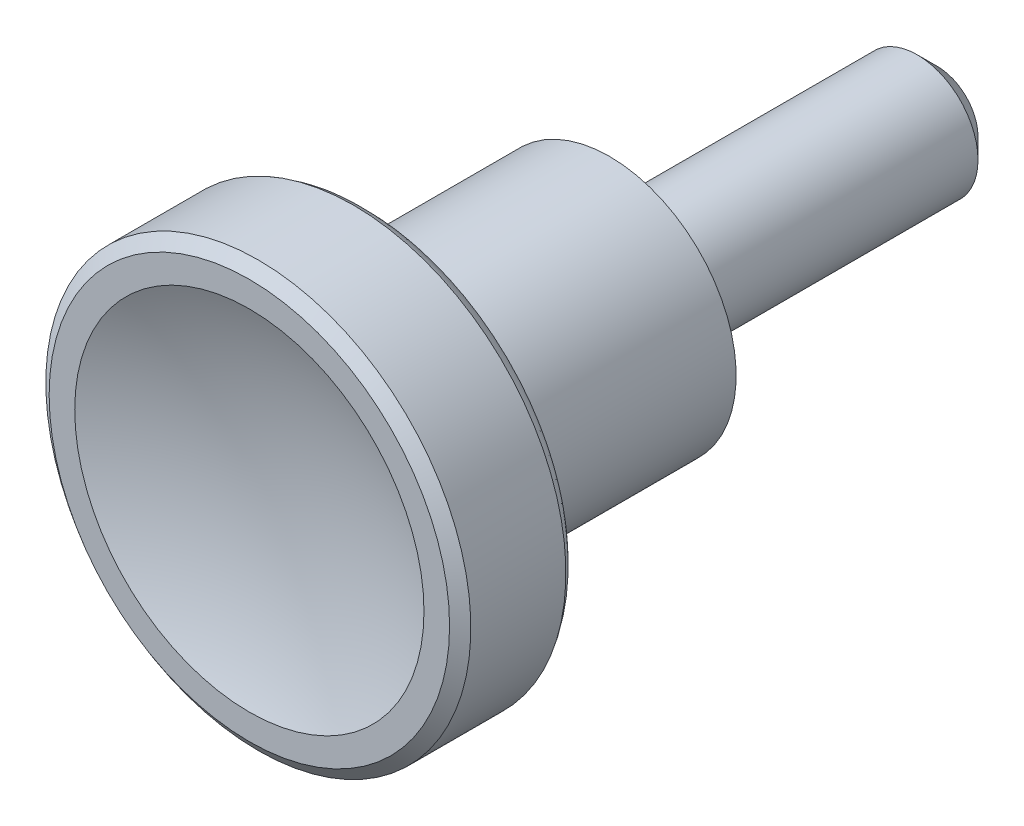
ISO-10303-21;
HEADER;
FILE_DESCRIPTION(('STEP AP214'),'2;1');
FILE_NAME('part.step','',(''),(''),'','','');
FILE_SCHEMA(('AUTOMOTIVE_DESIGN { 1 0 10303 214 1 1 1 1 }'));
ENDSEC;
DATA;
#1=APPLICATION_CONTEXT('core data for automotive mechanical design processes');
#2=APPLICATION_PROTOCOL_DEFINITION('international standard','automotive_design',2000,#1);
#3=PRODUCT_CONTEXT('',#1,'mechanical');
#4=PRODUCT('Part','Part','',(#3));
#5=PRODUCT_RELATED_PRODUCT_CATEGORY('part','',(#4));
#6=PRODUCT_DEFINITION_FORMATION('','',#4);
#7=PRODUCT_DEFINITION_CONTEXT('part definition',#1,'design');
#8=PRODUCT_DEFINITION('design','',#6,#7);
#9=PRODUCT_DEFINITION_SHAPE('','',#8);
#10=(LENGTH_UNIT() NAMED_UNIT(*) SI_UNIT(.MILLI.,.METRE.));
#11=(NAMED_UNIT(*) PLANE_ANGLE_UNIT() SI_UNIT($,.RADIAN.));
#12=(NAMED_UNIT(*) SI_UNIT($,.STERADIAN.) SOLID_ANGLE_UNIT());
#13=UNCERTAINTY_MEASURE_WITH_UNIT(LENGTH_MEASURE(1.E-05),#10,'distance_accuracy_value','');
#14=(GEOMETRIC_REPRESENTATION_CONTEXT(3) GLOBAL_UNCERTAINTY_ASSIGNED_CONTEXT((#13)) GLOBAL_UNIT_ASSIGNED_CONTEXT((#10,
#11,#12)) REPRESENTATION_CONTEXT('',''));
#15=CARTESIAN_POINT('',(0.,0.,0.));
#16=DIRECTION('',(0.,0.,1.));
#17=DIRECTION('',(1.,0.,0.));
#18=AXIS2_PLACEMENT_3D('',#15,#16,#17);
#19=CARTESIAN_POINT('',(2.5,0.,0.));
#20=DIRECTION('',(0.,0.,1.));
#21=DIRECTION('',(0.,-1.,0.));
#22=AXIS2_PLACEMENT_3D('',#19,#20,#21);
#23=PLANE('',#22);
#24=CARTESIAN_POINT('',(0.,0.,0.));
#25=DIRECTION('',(0.,0.,1.));
#26=DIRECTION('',(0.,-1.,0.));
#27=AXIS2_PLACEMENT_3D('',#24,#25,#26);
#28=CIRCLE('',#27,4.);
#29=CARTESIAN_POINT('',(0.,-4.,0.));
#30=VERTEX_POINT('',#29);
#31=EDGE_CURVE('E53',#30,#30,#28,.T.);
#32=ORIENTED_EDGE('',*,*,#31,.F.);
#33=EDGE_LOOP('',(#32));
#34=FACE_BOUND('',#33,.T.);
#35=CARTESIAN_POINT('',(0.,0.,0.));
#36=DIRECTION('',(0.,0.,1.));
#37=DIRECTION('',(1.,0.,0.));
#38=AXIS2_PLACEMENT_3D('',#35,#36,#37);
#39=CIRCLE('',#38,3.);
#40=CARTESIAN_POINT('',(3.,0.,0.));
#41=VERTEX_POINT('',#40);
#42=EDGE_CURVE('E23',#41,#41,#39,.F.);
#43=ORIENTED_EDGE('',*,*,#42,.F.);
#44=EDGE_LOOP('',(#43));
#45=FACE_BOUND('',#44,.T.);
#46=ADVANCED_FACE('F12',(#34,#45),#23,.F.);
#47=CARTESIAN_POINT('',(4.0000061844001,0.,0.2));
#48=DIRECTION('',(0.,0.,1.));
#49=DIRECTION('',(0.,-1.,0.));
#50=AXIS2_PLACEMENT_3D('',#47,#48,#49);
#51=PLANE('',#50);
#52=CARTESIAN_POINT('',(0.,0.,0.2));
#53=DIRECTION('',(0.,0.,1.));
#54=DIRECTION('',(0.,-1.,0.));
#55=AXIS2_PLACEMENT_3D('',#52,#53,#54);
#56=CIRCLE('',#55,6.25);
#57=CARTESIAN_POINT('',(0.,-6.25,0.2));
#58=VERTEX_POINT('',#57);
#59=EDGE_CURVE('E27',#58,#58,#56,.T.);
#60=ORIENTED_EDGE('',*,*,#59,.F.);
#61=EDGE_LOOP('',(#60));
#62=FACE_BOUND('',#61,.T.);
#63=CARTESIAN_POINT('',(0.,0.,0.2));
#64=DIRECTION('',(0.,0.,1.));
#65=DIRECTION('',(0.,-1.,0.));
#66=AXIS2_PLACEMENT_3D('',#63,#64,#65);
#67=CIRCLE('',#66,4.00000618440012);
#68=CARTESIAN_POINT('',(0.,-4.00000618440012,0.2));
#69=VERTEX_POINT('',#68);
#70=EDGE_CURVE('E56',#69,#69,#67,.T.);
#71=ORIENTED_EDGE('',*,*,#70,.T.);
#72=EDGE_LOOP('',(#71));
#73=FACE_BOUND('',#72,.T.);
#74=ADVANCED_FACE('F60',(#62,#73),#51,.F.);
#75=CARTESIAN_POINT('',(0.,0.,-4.66300152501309));
#76=DIRECTION('',(0.,0.,1.));
#77=DIRECTION('',(0.,-1.,0.));
#78=AXIS2_PLACEMENT_3D('',#75,#76,#77);
#79=CYLINDRICAL_SURFACE('',#78,6.25);
#80=CARTESIAN_POINT('',(0.,0.,10.5));
#81=DIRECTION('',(0.,0.,1.));
#82=DIRECTION('',(0.,-1.,0.));
#83=AXIS2_PLACEMENT_3D('',#80,#81,#82);
#84=CIRCLE('',#83,6.25);
#85=CARTESIAN_POINT('',(0.,-6.25,10.5));
#86=VERTEX_POINT('',#85);
#87=EDGE_CURVE('E32',#86,#86,#84,.T.);
#88=ORIENTED_EDGE('',*,*,#87,.F.);
#89=EDGE_LOOP('',(#88));
#90=FACE_BOUND('',#89,.T.);
#91=ORIENTED_EDGE('',*,*,#59,.T.);
#92=EDGE_LOOP('',(#91));
#93=FACE_BOUND('',#92,.T.);
#94=ADVANCED_FACE('F86',(#90,#93),#79,.T.);
#95=CARTESIAN_POINT('',(0.,0.,10.4930187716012));
#96=DIRECTION('',(0.,0.,1.));
#97=DIRECTION('',(0.,-1.,0.));
#98=AXIS2_PLACEMENT_3D('',#95,#96,#97);
#99=TOROIDAL_SURFACE('',#98,7.04996953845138,0.800000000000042);
#100=ORIENTED_EDGE('',*,*,#87,.T.);
#101=EDGE_LOOP('',(#100));
#102=FACE_BOUND('',#101,.T.);
#103=CARTESIAN_POINT('',(0.,0.,11.2657594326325));
#104=DIRECTION('',(0.,0.,1.));
#105=DIRECTION('',(0.,-1.,0.));
#106=AXIS2_PLACEMENT_3D('',#103,#104,#105);
#107=CIRCLE('',#106,6.84291430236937);
#108=CARTESIAN_POINT('',(0.,-6.84291430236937,11.2657594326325));
#109=VERTEX_POINT('',#108);
#110=EDGE_CURVE('E35',#109,#109,#107,.T.);
#111=ORIENTED_EDGE('',*,*,#110,.F.);
#112=EDGE_LOOP('',(#111));
#113=FACE_BOUND('',#112,.T.);
#114=ADVANCED_FACE('F111',(#102,#113),#99,.F.);
#115=CARTESIAN_POINT('',(0.,0.,11.8244404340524));
#116=DIRECTION('',(0.,0.,1.));
#117=DIRECTION('',(0.,-1.,0.));
#118=AXIS2_PLACEMENT_3D('',#115,#116,#117);
#119=CONICAL_SURFACE('',#118,8.92794018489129,1.30899693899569);
#120=ORIENTED_EDGE('',*,*,#110,.T.);
#121=EDGE_LOOP('',(#120));
#122=FACE_BOUND('',#121,.T.);
#123=CARTESIAN_POINT('',(0.,0.,11.8244404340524));
#124=DIRECTION('',(0.,0.,1.));
#125=DIRECTION('',(0.,-1.,0.));
#126=AXIS2_PLACEMENT_3D('',#123,#124,#125);
#127=CIRCLE('',#126,8.92794018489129);
#128=CARTESIAN_POINT('',(0.,-8.92794018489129,11.8244404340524));
#129=VERTEX_POINT('',#128);
#130=EDGE_CURVE('E38',#129,#129,#127,.T.);
#131=ORIENTED_EDGE('',*,*,#130,.F.);
#132=EDGE_LOOP('',(#131));
#133=FACE_BOUND('',#132,.T.);
#134=ADVANCED_FACE('F107',(#122,#133),#119,.T.);
#135=CARTESIAN_POINT('',(0.,0.,13.8158755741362));
#136=DIRECTION('',(0.,0.,1.));
#137=DIRECTION('',(0.,-1.,0.));
#138=AXIS2_PLACEMENT_3D('',#135,#136,#137);
#139=TOROIDAL_SURFACE('',#138,8.74304539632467,2.);
#140=CARTESIAN_POINT('',(0.,0.,12.860307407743));
#141=DIRECTION('',(0.,0.,1.));
#142=DIRECTION('',(0.,-1.,0.));
#143=AXIS2_PLACEMENT_3D('',#140,#141,#142);
#144=CIRCLE('',#143,10.5);
#145=CARTESIAN_POINT('',(0.,-10.5,12.860307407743));
#146=VERTEX_POINT('',#145);
#147=EDGE_CURVE('E41',#146,#146,#144,.T.);
#148=ORIENTED_EDGE('',*,*,#147,.F.);
#149=EDGE_LOOP('',(#148));
#150=FACE_BOUND('',#149,.T.);
#151=ORIENTED_EDGE('',*,*,#130,.T.);
#152=EDGE_LOOP('',(#151));
#153=FACE_BOUND('',#152,.T.);
#154=ADVANCED_FACE('F103',(#150,#153),#139,.T.);
#155=CARTESIAN_POINT('',(0.,0.,-4.66300152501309));
#156=DIRECTION('',(0.,0.,1.));
#157=DIRECTION('',(0.,-1.,0.));
#158=AXIS2_PLACEMENT_3D('',#155,#156,#157);
#159=CYLINDRICAL_SURFACE('',#158,10.5);
#160=ORIENTED_EDGE('',*,*,#147,.T.);
#161=EDGE_LOOP('',(#160));
#162=FACE_BOUND('',#161,.T.);
#163=CARTESIAN_POINT('',(0.,0.,17.5568228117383));
#164=DIRECTION('',(0.,0.,1.));
#165=DIRECTION('',(0.,-1.,0.));
#166=AXIS2_PLACEMENT_3D('',#163,#164,#165);
#167=CIRCLE('',#166,10.5);
#168=CARTESIAN_POINT('',(0.,-10.5,17.5568228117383));
#169=VERTEX_POINT('',#168);
#170=EDGE_CURVE('E44',#169,#169,#167,.T.);
#171=ORIENTED_EDGE('',*,*,#170,.F.);
#172=EDGE_LOOP('',(#171));
#173=FACE_BOUND('',#172,.T.);
#174=ADVANCED_FACE('F99',(#162,#173),#159,.T.);
#175=CARTESIAN_POINT('',(0.,0.,18.));
#176=DIRECTION('',(0.,0.,-1.));
#177=DIRECTION('',(0.,1.,0.));
#178=AXIS2_PLACEMENT_3D('',#175,#176,#177);
#179=CONICAL_SURFACE('',#178,9.89229141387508,0.94070188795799);
#180=ORIENTED_EDGE('',*,*,#170,.T.);
#181=EDGE_LOOP('',(#180));
#182=FACE_BOUND('',#181,.T.);
#183=CARTESIAN_POINT('',(0.,0.,18.));
#184=DIRECTION('',(0.,0.,1.));
#185=DIRECTION('',(0.,-1.,0.));
#186=AXIS2_PLACEMENT_3D('',#183,#184,#185);
#187=CIRCLE('',#186,9.89229141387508);
#188=CARTESIAN_POINT('',(0.,-9.89229141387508,18.));
#189=VERTEX_POINT('',#188);
#190=EDGE_CURVE('E47',#189,#189,#187,.T.);
#191=ORIENTED_EDGE('',*,*,#190,.F.);
#192=EDGE_LOOP('',(#191));
#193=FACE_BOUND('',#192,.T.);
#194=ADVANCED_FACE('F95',(#182,#193),#179,.T.);
#195=CARTESIAN_POINT('',(9.89229141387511,0.,18.));
#196=DIRECTION('',(0.,0.,-1.));
#197=DIRECTION('',(0.,1.,0.));
#198=AXIS2_PLACEMENT_3D('',#195,#196,#197);
#199=PLANE('',#198);
#200=CARTESIAN_POINT('',(0.,0.,18.));
#201=DIRECTION('',(0.,0.,1.));
#202=DIRECTION('',(0.,-1.,0.));
#203=AXIS2_PLACEMENT_3D('',#200,#201,#202);
#204=CIRCLE('',#203,8.62772401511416);
#205=CARTESIAN_POINT('',(0.,-8.62772401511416,18.));
#206=VERTEX_POINT('',#205);
#207=EDGE_CURVE('E50',#206,#206,#204,.T.);
#208=ORIENTED_EDGE('',*,*,#207,.F.);
#209=EDGE_LOOP('',(#208));
#210=FACE_BOUND('',#209,.T.);
#211=ORIENTED_EDGE('',*,*,#190,.T.);
#212=EDGE_LOOP('',(#211));
#213=FACE_BOUND('',#212,.T.);
#214=ADVANCED_FACE('F76',(#210,#213),#199,.F.);
#215=CARTESIAN_POINT('',(0.,0.,37.5129983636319));
#216=DIRECTION('',(0.,-1.,0.));
#217=DIRECTION('',(1.,0.,0.));
#218=AXIS2_PLACEMENT_3D('',#215,#216,#217);
#219=SPHERICAL_SURFACE('',#218,21.3352929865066);
#220=CARTESIAN_POINT('',(0.,0.,37.5129983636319));
#221=DIRECTION('',(0.,0.,1.));
#222=DIRECTION('',(0.,-1.,0.));
#223=AXIS2_PLACEMENT_3D('',#220,#221,#222);
#224=SPHERICAL_SURFACE('',#223,21.3352929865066);
#225=ORIENTED_EDGE('',*,*,#207,.T.);
#226=EDGE_LOOP('',(#225));
#227=FACE_BOUND('',#226,.T.);
#228=ADVANCED_FACE('F65',(#227),#224,.F.);
#229=CARTESIAN_POINT('',(0.,0.,-4.66300152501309));
#230=DIRECTION('',(0.,0.,1.));
#231=DIRECTION('',(0.,-1.,0.));
#232=AXIS2_PLACEMENT_3D('',#229,#230,#231);
#233=CYLINDRICAL_SURFACE('',#232,4.00000309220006);
#234=ORIENTED_EDGE('',*,*,#31,.T.);
#235=EDGE_LOOP('',(#234));
#236=FACE_BOUND('',#235,.T.);
#237=ORIENTED_EDGE('',*,*,#70,.F.);
#238=EDGE_LOOP('',(#237));
#239=FACE_BOUND('',#238,.T.);
#240=ADVANCED_FACE('F62',(#236,#239),#233,.T.);
#241=CARTESIAN_POINT('',(0.,0.,-16.));
#242=DIRECTION('',(0.,0.,1.));
#243=DIRECTION('',(1.,0.,0.));
#244=AXIS2_PLACEMENT_3D('',#241,#242,#243);
#245=CYLINDRICAL_SURFACE('',#244,3.);
#246=CARTESIAN_POINT('',(0.,0.,-15.));
#247=DIRECTION('',(0.,0.,-1.));
#248=DIRECTION('',(-1.,0.,0.));
#249=AXIS2_PLACEMENT_3D('',#246,#247,#248);
#250=CIRCLE('',#249,3.);
#251=CARTESIAN_POINT('',(-3.,0.,-15.));
#252=VERTEX_POINT('',#251);
#253=EDGE_CURVE('E8',#252,#252,#250,.F.);
#254=ORIENTED_EDGE('',*,*,#253,.T.);
#255=EDGE_LOOP('',(#254));
#256=FACE_BOUND('',#255,.T.);
#257=ORIENTED_EDGE('',*,*,#42,.T.);
#258=EDGE_LOOP('',(#257));
#259=FACE_BOUND('',#258,.T.);
#260=ADVANCED_FACE('F64',(#256,#259),#245,.T.);
#261=CARTESIAN_POINT('',(2.5,0.,-16.));
#262=DIRECTION('',(0.,0.,-1.));
#263=DIRECTION('',(0.,1.,0.));
#264=AXIS2_PLACEMENT_3D('',#261,#262,#263);
#265=PLANE('',#264);
#266=CARTESIAN_POINT('',(0.,0.,-16.));
#267=DIRECTION('',(0.,0.,-1.));
#268=DIRECTION('',(-1.,0.,0.));
#269=AXIS2_PLACEMENT_3D('',#266,#267,#268);
#270=CIRCLE('',#269,2.);
#271=CARTESIAN_POINT('',(-2.,0.,-16.));
#272=VERTEX_POINT('',#271);
#273=EDGE_CURVE('E19',#272,#272,#270,.T.);
#274=ORIENTED_EDGE('',*,*,#273,.T.);
#275=EDGE_LOOP('',(#274));
#276=FACE_BOUND('',#275,.T.);
#277=ADVANCED_FACE('F74',(#276),#265,.T.);
#278=CARTESIAN_POINT('',(0.,0.,-16.));
#279=DIRECTION('',(0.,0.,1.));
#280=DIRECTION('',(1.,0.,0.));
#281=AXIS2_PLACEMENT_3D('',#278,#279,#280);
#282=CONICAL_SURFACE('',#281,2.,0.78539816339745);
#283=ORIENTED_EDGE('',*,*,#253,.F.);
#284=EDGE_LOOP('',(#283));
#285=FACE_BOUND('',#284,.T.);
#286=ORIENTED_EDGE('',*,*,#273,.F.);
#287=EDGE_LOOP('',(#286));
#288=FACE_BOUND('',#287,.T.);
#289=ADVANCED_FACE('F14',(#285,#288),#282,.T.);
#290=CLOSED_SHELL('',(#46,#74,#94,#114,#134,#154,#174,#194,#214,#228,#240,#260,#277,#289));
#291=MANIFOLD_SOLID_BREP('B1',#290);
#292=ADVANCED_BREP_SHAPE_REPRESENTATION('',(#18,#291),#14);
#293=SHAPE_DEFINITION_REPRESENTATION(#9,#292);
ENDSEC;
END-ISO-10303-21;
